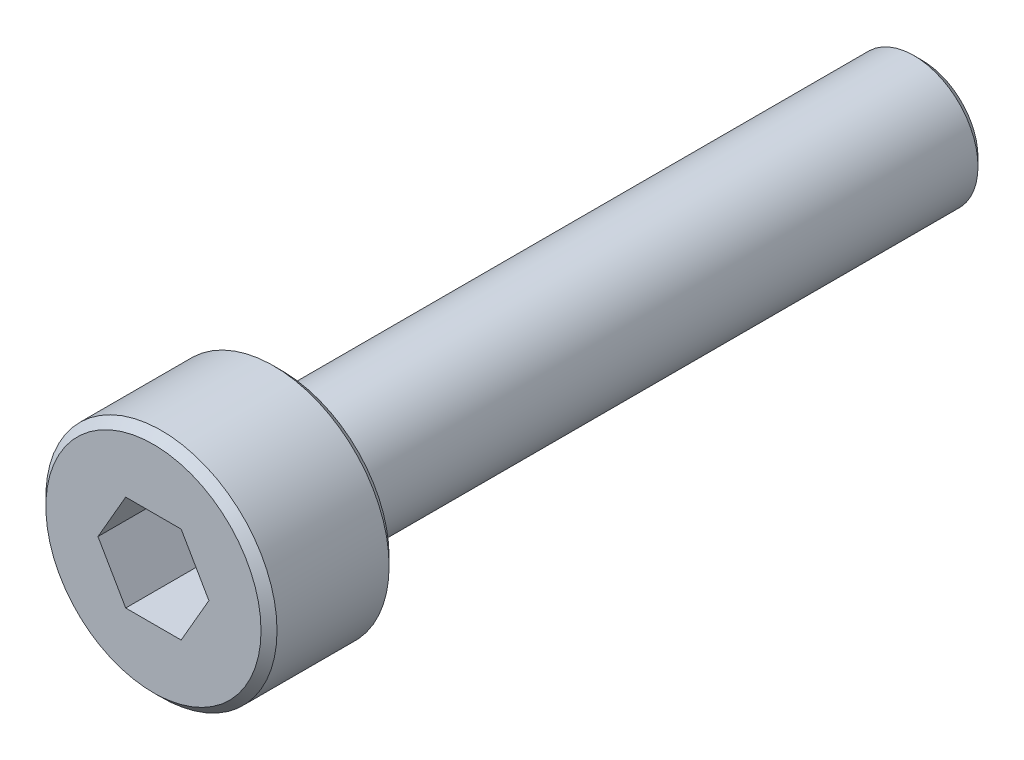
ISO-10303-21;
HEADER;
FILE_DESCRIPTION(('STEP AP214'),'2;1');
FILE_NAME('part.step','',(''),(''),'','','');
FILE_SCHEMA(('AUTOMOTIVE_DESIGN { 1 0 10303 214 1 1 1 1 }'));
ENDSEC;
DATA;
#1=APPLICATION_CONTEXT('core data for automotive mechanical design processes');
#2=APPLICATION_PROTOCOL_DEFINITION('international standard','automotive_design',2000,#1);
#3=PRODUCT_CONTEXT('',#1,'mechanical');
#4=PRODUCT('Part','Part','',(#3));
#5=PRODUCT_RELATED_PRODUCT_CATEGORY('part','',(#4));
#6=PRODUCT_DEFINITION_FORMATION('','',#4);
#7=PRODUCT_DEFINITION_CONTEXT('part definition',#1,'design');
#8=PRODUCT_DEFINITION('design','',#6,#7);
#9=PRODUCT_DEFINITION_SHAPE('','',#8);
#10=(LENGTH_UNIT() NAMED_UNIT(*) SI_UNIT(.MILLI.,.METRE.));
#11=(NAMED_UNIT(*) PLANE_ANGLE_UNIT() SI_UNIT($,.RADIAN.));
#12=(NAMED_UNIT(*) SI_UNIT($,.STERADIAN.) SOLID_ANGLE_UNIT());
#13=UNCERTAINTY_MEASURE_WITH_UNIT(LENGTH_MEASURE(1.E-05),#10,'distance_accuracy_value','');
#14=(GEOMETRIC_REPRESENTATION_CONTEXT(3) GLOBAL_UNCERTAINTY_ASSIGNED_CONTEXT((#13)) GLOBAL_UNIT_ASSIGNED_CONTEXT((#10,
#11,#12)) REPRESENTATION_CONTEXT('',''));
#15=CARTESIAN_POINT('',(0.,0.,0.));
#16=DIRECTION('',(0.,0.,1.));
#17=DIRECTION('',(1.,0.,0.));
#18=AXIS2_PLACEMENT_3D('',#15,#16,#17);
#19=CARTESIAN_POINT('',(0.,0.,20.));
#20=DIRECTION('',(0.,0.,-1.));
#21=DIRECTION('',(-1.,0.,0.));
#22=AXIS2_PLACEMENT_3D('',#19,#20,#21);
#23=CYLINDRICAL_SURFACE('',#22,2.);
#24=CARTESIAN_POINT('',(0.,0.,0.250000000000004));
#25=DIRECTION('',(0.,0.,1.));
#26=DIRECTION('',(1.,0.,0.));
#27=AXIS2_PLACEMENT_3D('',#24,#25,#26);
#28=CIRCLE('',#27,2.);
#29=CARTESIAN_POINT('',(2.,0.,0.250000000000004));
#30=VERTEX_POINT('',#29);
#31=EDGE_CURVE('E179',#30,#30,#28,.T.);
#32=ORIENTED_EDGE('',*,*,#31,.T.);
#33=EDGE_LOOP('',(#32));
#34=FACE_BOUND('',#33,.T.);
#35=CARTESIAN_POINT('',(0.,0.,20.));
#36=DIRECTION('',(0.,0.,1.));
#37=DIRECTION('',(1.,0.,0.));
#38=AXIS2_PLACEMENT_3D('',#35,#36,#37);
#39=CIRCLE('',#38,2.);
#40=CARTESIAN_POINT('',(2.,0.,20.));
#41=VERTEX_POINT('',#40);
#42=EDGE_CURVE('E162',#41,#41,#39,.T.);
#43=ORIENTED_EDGE('',*,*,#42,.F.);
#44=EDGE_LOOP('',(#43));
#45=FACE_BOUND('',#44,.T.);
#46=ADVANCED_FACE('F50',(#34,#45),#23,.T.);
#47=CARTESIAN_POINT('',(0.,0.,0.));
#48=DIRECTION('',(0.,0.,1.));
#49=DIRECTION('',(1.,0.,0.));
#50=AXIS2_PLACEMENT_3D('',#47,#48,#49);
#51=PLANE('',#50);
#52=CARTESIAN_POINT('',(0.,0.,0.));
#53=DIRECTION('',(0.,0.,1.));
#54=DIRECTION('',(1.,0.,0.));
#55=AXIS2_PLACEMENT_3D('',#52,#53,#54);
#56=CIRCLE('',#55,1.75);
#57=CARTESIAN_POINT('',(1.75,0.,0.));
#58=VERTEX_POINT('',#57);
#59=EDGE_CURVE('E177',#58,#58,#56,.F.);
#60=ORIENTED_EDGE('',*,*,#59,.T.);
#61=EDGE_LOOP('',(#60));
#62=FACE_BOUND('',#61,.T.);
#63=ADVANCED_FACE('F208',(#62),#51,.F.);
#64=CARTESIAN_POINT('',(0.,0.,24.));
#65=DIRECTION('',(0.,0.,-1.));
#66=DIRECTION('',(-1.,0.,0.));
#67=AXIS2_PLACEMENT_3D('',#64,#65,#66);
#68=CYLINDRICAL_SURFACE('',#67,3.61);
#69=CARTESIAN_POINT('',(0.,0.,20.25));
#70=DIRECTION('',(0.,0.,1.));
#71=DIRECTION('',(1.,0.,0.));
#72=AXIS2_PLACEMENT_3D('',#69,#70,#71);
#73=CIRCLE('',#72,3.61);
#74=CARTESIAN_POINT('',(3.61,0.,20.25));
#75=VERTEX_POINT('',#74);
#76=EDGE_CURVE('E186',#75,#75,#73,.T.);
#77=ORIENTED_EDGE('',*,*,#76,.T.);
#78=EDGE_LOOP('',(#77));
#79=FACE_BOUND('',#78,.T.);
#80=CARTESIAN_POINT('',(0.,0.,23.75));
#81=DIRECTION('',(0.,0.,1.));
#82=DIRECTION('',(1.,0.,0.));
#83=AXIS2_PLACEMENT_3D('',#80,#81,#82);
#84=CIRCLE('',#83,3.61);
#85=CARTESIAN_POINT('',(3.61,0.,23.75));
#86=VERTEX_POINT('',#85);
#87=EDGE_CURVE('E184',#86,#86,#84,.F.);
#88=ORIENTED_EDGE('',*,*,#87,.T.);
#89=EDGE_LOOP('',(#88));
#90=FACE_BOUND('',#89,.T.);
#91=ADVANCED_FACE('F204',(#79,#90),#68,.T.);
#92=CARTESIAN_POINT('',(0.,0.,24.));
#93=DIRECTION('',(0.,0.,1.));
#94=DIRECTION('',(1.,0.,0.));
#95=AXIS2_PLACEMENT_3D('',#92,#93,#94);
#96=PLANE('',#95);
#97=CARTESIAN_POINT('',(0.,0.,24.));
#98=DIRECTION('',(0.,0.,1.));
#99=DIRECTION('',(1.,0.,0.));
#100=AXIS2_PLACEMENT_3D('',#97,#98,#99);
#101=CIRCLE('',#100,3.35999999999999);
#102=CARTESIAN_POINT('',(3.35999999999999,0.,24.));
#103=VERTEX_POINT('',#102);
#104=EDGE_CURVE('E11',#103,#103,#101,.T.);
#105=ORIENTED_EDGE('',*,*,#104,.T.);
#106=EDGE_LOOP('',(#105));
#107=FACE_BOUND('',#106,.T.);
#108=DIRECTION('',(0.5,0.866025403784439,0.));
#109=VECTOR('',#108,1.);
#110=CARTESIAN_POINT('',(0.866025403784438,-1.5,24.));
#111=LINE('',#110,#109);
#112=CARTESIAN_POINT('',(0.866025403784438,-1.5,24.));
#113=VERTEX_POINT('',#112);
#114=CARTESIAN_POINT('',(1.73205080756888,0.,24.));
#115=VERTEX_POINT('',#114);
#116=EDGE_CURVE('E64',#113,#115,#111,.T.);
#117=ORIENTED_EDGE('',*,*,#116,.F.);
#118=DIRECTION('',(1.,0.,0.));
#119=VECTOR('',#118,1.);
#120=CARTESIAN_POINT('',(-0.866025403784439,-1.5,24.));
#121=LINE('',#120,#119);
#122=CARTESIAN_POINT('',(-0.866025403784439,-1.5,24.));
#123=VERTEX_POINT('',#122);
#124=EDGE_CURVE('E160',#123,#113,#121,.T.);
#125=ORIENTED_EDGE('',*,*,#124,.F.);
#126=DIRECTION('',(0.5,-0.866025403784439,0.));
#127=VECTOR('',#126,1.);
#128=CARTESIAN_POINT('',(-1.73205080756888,0.,24.));
#129=LINE('',#128,#127);
#130=CARTESIAN_POINT('',(-1.73205080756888,0.,24.));
#131=VERTEX_POINT('',#130);
#132=EDGE_CURVE('E152',#131,#123,#129,.T.);
#133=ORIENTED_EDGE('',*,*,#132,.F.);
#134=DIRECTION('',(-0.5,-0.866025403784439,0.));
#135=VECTOR('',#134,1.);
#136=CARTESIAN_POINT('',(-0.866025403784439,1.5,24.));
#137=LINE('',#136,#135);
#138=CARTESIAN_POINT('',(-0.866025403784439,1.5,24.));
#139=VERTEX_POINT('',#138);
#140=EDGE_CURVE('E115',#139,#131,#137,.T.);
#141=ORIENTED_EDGE('',*,*,#140,.F.);
#142=DIRECTION('',(-1.,0.,0.));
#143=VECTOR('',#142,1.);
#144=CARTESIAN_POINT('',(0.866025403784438,1.5,24.));
#145=LINE('',#144,#143);
#146=CARTESIAN_POINT('',(0.866025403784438,1.5,24.));
#147=VERTEX_POINT('',#146);
#148=EDGE_CURVE('E146',#147,#139,#145,.T.);
#149=ORIENTED_EDGE('',*,*,#148,.F.);
#150=DIRECTION('',(-0.5,0.866025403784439,0.));
#151=VECTOR('',#150,1.);
#152=CARTESIAN_POINT('',(1.73205080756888,0.,24.));
#153=LINE('',#152,#151);
#154=EDGE_CURVE('E145',#115,#147,#153,.T.);
#155=ORIENTED_EDGE('',*,*,#154,.F.);
#156=EDGE_LOOP('',(#117,#125,#133,#141,#149,#155));
#157=FACE_BOUND('',#156,.T.);
#158=ADVANCED_FACE('F210',(#107,#157),#96,.T.);
#159=CARTESIAN_POINT('',(0.,0.,20.));
#160=DIRECTION('',(0.,0.,1.));
#161=DIRECTION('',(1.,0.,0.));
#162=AXIS2_PLACEMENT_3D('',#159,#160,#161);
#163=PLANE('',#162);
#164=CARTESIAN_POINT('',(0.,0.,20.));
#165=DIRECTION('',(0.,0.,1.));
#166=DIRECTION('',(1.,0.,0.));
#167=AXIS2_PLACEMENT_3D('',#164,#165,#166);
#168=CIRCLE('',#167,3.36);
#169=CARTESIAN_POINT('',(3.36,0.,20.));
#170=VERTEX_POINT('',#169);
#171=EDGE_CURVE('E60',#170,#170,#168,.F.);
#172=ORIENTED_EDGE('',*,*,#171,.T.);
#173=EDGE_LOOP('',(#172));
#174=FACE_BOUND('',#173,.T.);
#175=ORIENTED_EDGE('',*,*,#42,.T.);
#176=EDGE_LOOP('',(#175));
#177=FACE_BOUND('',#176,.T.);
#178=ADVANCED_FACE('F192',(#174,#177),#163,.F.);
#179=CARTESIAN_POINT('',(0.866025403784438,-1.5,21.5));
#180=DIRECTION('',(0.866025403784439,-0.5,0.));
#181=DIRECTION('',(0.5,0.866025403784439,0.));
#182=AXIS2_PLACEMENT_3D('',#179,#180,#181);
#183=PLANE('',#182);
#184=ORIENTED_EDGE('',*,*,#116,.T.);
#185=DIRECTION('',(0.,0.,1.));
#186=VECTOR('',#185,1.);
#187=CARTESIAN_POINT('',(1.73205080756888,0.,21.5));
#188=LINE('',#187,#186);
#189=CARTESIAN_POINT('',(1.73205080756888,0.,21.5));
#190=VERTEX_POINT('',#189);
#191=EDGE_CURVE('E94',#190,#115,#188,.T.);
#192=ORIENTED_EDGE('',*,*,#191,.F.);
#193=DIRECTION('',(0.5,0.866025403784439,0.));
#194=VECTOR('',#193,1.);
#195=CARTESIAN_POINT('',(0.866025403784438,-1.5,21.5));
#196=LINE('',#195,#194);
#197=CARTESIAN_POINT('',(0.866025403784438,-1.5,21.5));
#198=VERTEX_POINT('',#197);
#199=EDGE_CURVE('E159',#198,#190,#196,.T.);
#200=ORIENTED_EDGE('',*,*,#199,.F.);
#201=DIRECTION('',(0.,0.,1.));
#202=VECTOR('',#201,1.);
#203=CARTESIAN_POINT('',(0.866025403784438,-1.5,21.5));
#204=LINE('',#203,#202);
#205=EDGE_CURVE('E75',#198,#113,#204,.T.);
#206=ORIENTED_EDGE('',*,*,#205,.T.);
#207=EDGE_LOOP('',(#184,#192,#200,#206));
#208=FACE_BOUND('',#207,.T.);
#209=ADVANCED_FACE('F230',(#208),#183,.F.);
#210=CARTESIAN_POINT('',(-0.866025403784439,-1.5,21.5));
#211=DIRECTION('',(0.,-1.,0.));
#212=DIRECTION('',(1.,0.,0.));
#213=AXIS2_PLACEMENT_3D('',#210,#211,#212);
#214=PLANE('',#213);
#215=ORIENTED_EDGE('',*,*,#124,.T.);
#216=ORIENTED_EDGE('',*,*,#205,.F.);
#217=DIRECTION('',(1.,0.,0.));
#218=VECTOR('',#217,1.);
#219=CARTESIAN_POINT('',(-0.866025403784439,-1.5,21.5));
#220=LINE('',#219,#218);
#221=CARTESIAN_POINT('',(-0.866025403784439,-1.5,21.5));
#222=VERTEX_POINT('',#221);
#223=EDGE_CURVE('E127',#222,#198,#220,.T.);
#224=ORIENTED_EDGE('',*,*,#223,.F.);
#225=DIRECTION('',(0.,0.,1.));
#226=VECTOR('',#225,1.);
#227=CARTESIAN_POINT('',(-0.866025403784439,-1.5,21.5));
#228=LINE('',#227,#226);
#229=EDGE_CURVE('E120',#222,#123,#228,.T.);
#230=ORIENTED_EDGE('',*,*,#229,.T.);
#231=EDGE_LOOP('',(#215,#216,#224,#230));
#232=FACE_BOUND('',#231,.T.);
#233=ADVANCED_FACE('F229',(#232),#214,.F.);
#234=CARTESIAN_POINT('',(-1.73205080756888,0.,21.5));
#235=DIRECTION('',(-0.866025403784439,-0.5,0.));
#236=DIRECTION('',(0.5,-0.866025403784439,0.));
#237=AXIS2_PLACEMENT_3D('',#234,#235,#236);
#238=PLANE('',#237);
#239=ORIENTED_EDGE('',*,*,#132,.T.);
#240=ORIENTED_EDGE('',*,*,#229,.F.);
#241=DIRECTION('',(0.5,-0.866025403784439,0.));
#242=VECTOR('',#241,1.);
#243=CARTESIAN_POINT('',(-1.73205080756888,0.,21.5));
#244=LINE('',#243,#242);
#245=CARTESIAN_POINT('',(-1.73205080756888,0.,21.5));
#246=VERTEX_POINT('',#245);
#247=EDGE_CURVE('E124',#246,#222,#244,.T.);
#248=ORIENTED_EDGE('',*,*,#247,.F.);
#249=DIRECTION('',(0.,0.,1.));
#250=VECTOR('',#249,1.);
#251=CARTESIAN_POINT('',(-1.73205080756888,0.,21.5));
#252=LINE('',#251,#250);
#253=EDGE_CURVE('E104',#246,#131,#252,.T.);
#254=ORIENTED_EDGE('',*,*,#253,.T.);
#255=EDGE_LOOP('',(#239,#240,#248,#254));
#256=FACE_BOUND('',#255,.T.);
#257=ADVANCED_FACE('F121',(#256),#238,.F.);
#258=CARTESIAN_POINT('',(-0.866025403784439,1.5,21.5));
#259=DIRECTION('',(-0.866025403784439,0.5,0.));
#260=DIRECTION('',(-0.5,-0.866025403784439,0.));
#261=AXIS2_PLACEMENT_3D('',#258,#259,#260);
#262=PLANE('',#261);
#263=ORIENTED_EDGE('',*,*,#140,.T.);
#264=ORIENTED_EDGE('',*,*,#253,.F.);
#265=DIRECTION('',(-0.5,-0.866025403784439,0.));
#266=VECTOR('',#265,1.);
#267=CARTESIAN_POINT('',(-0.866025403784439,1.5,21.5));
#268=LINE('',#267,#266);
#269=CARTESIAN_POINT('',(-0.866025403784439,1.5,21.5));
#270=VERTEX_POINT('',#269);
#271=EDGE_CURVE('E108',#270,#246,#268,.T.);
#272=ORIENTED_EDGE('',*,*,#271,.F.);
#273=DIRECTION('',(0.,0.,1.));
#274=VECTOR('',#273,1.);
#275=CARTESIAN_POINT('',(-0.866025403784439,1.5,21.5));
#276=LINE('',#275,#274);
#277=EDGE_CURVE('E116',#270,#139,#276,.T.);
#278=ORIENTED_EDGE('',*,*,#277,.T.);
#279=EDGE_LOOP('',(#263,#264,#272,#278));
#280=FACE_BOUND('',#279,.T.);
#281=ADVANCED_FACE('F110',(#280),#262,.F.);
#282=CARTESIAN_POINT('',(0.866025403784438,1.5,21.5));
#283=DIRECTION('',(0.,1.,0.));
#284=DIRECTION('',(-1.,0.,0.));
#285=AXIS2_PLACEMENT_3D('',#282,#283,#284);
#286=PLANE('',#285);
#287=ORIENTED_EDGE('',*,*,#148,.T.);
#288=ORIENTED_EDGE('',*,*,#277,.F.);
#289=DIRECTION('',(-1.,0.,0.));
#290=VECTOR('',#289,1.);
#291=CARTESIAN_POINT('',(0.866025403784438,1.5,21.5));
#292=LINE('',#291,#290);
#293=CARTESIAN_POINT('',(0.866025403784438,1.5,21.5));
#294=VERTEX_POINT('',#293);
#295=EDGE_CURVE('E135',#294,#270,#292,.T.);
#296=ORIENTED_EDGE('',*,*,#295,.F.);
#297=DIRECTION('',(0.,0.,1.));
#298=VECTOR('',#297,1.);
#299=CARTESIAN_POINT('',(0.866025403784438,1.5,21.5));
#300=LINE('',#299,#298);
#301=EDGE_CURVE('E169',#294,#147,#300,.T.);
#302=ORIENTED_EDGE('',*,*,#301,.T.);
#303=EDGE_LOOP('',(#287,#288,#296,#302));
#304=FACE_BOUND('',#303,.T.);
#305=ADVANCED_FACE('F268',(#304),#286,.F.);
#306=CARTESIAN_POINT('',(1.73205080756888,0.,21.5));
#307=DIRECTION('',(0.866025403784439,0.5,0.));
#308=DIRECTION('',(-0.5,0.866025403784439,0.));
#309=AXIS2_PLACEMENT_3D('',#306,#307,#308);
#310=PLANE('',#309);
#311=ORIENTED_EDGE('',*,*,#154,.T.);
#312=ORIENTED_EDGE('',*,*,#301,.F.);
#313=DIRECTION('',(-0.5,0.866025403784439,0.));
#314=VECTOR('',#313,1.);
#315=CARTESIAN_POINT('',(1.73205080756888,0.,21.5));
#316=LINE('',#315,#314);
#317=EDGE_CURVE('E139',#190,#294,#316,.T.);
#318=ORIENTED_EDGE('',*,*,#317,.F.);
#319=ORIENTED_EDGE('',*,*,#191,.T.);
#320=EDGE_LOOP('',(#311,#312,#318,#319));
#321=FACE_BOUND('',#320,.T.);
#322=ADVANCED_FACE('F224',(#321),#310,.F.);
#323=CARTESIAN_POINT('',(0.,0.,21.5));
#324=DIRECTION('',(0.,0.,1.));
#325=DIRECTION('',(1.,0.,0.));
#326=AXIS2_PLACEMENT_3D('',#323,#324,#325);
#327=PLANE('',#326);
#328=ORIENTED_EDGE('',*,*,#199,.T.);
#329=ORIENTED_EDGE('',*,*,#317,.T.);
#330=ORIENTED_EDGE('',*,*,#295,.T.);
#331=ORIENTED_EDGE('',*,*,#271,.T.);
#332=ORIENTED_EDGE('',*,*,#247,.T.);
#333=ORIENTED_EDGE('',*,*,#223,.T.);
#334=EDGE_LOOP('',(#328,#329,#330,#331,#332,#333));
#335=FACE_BOUND('',#334,.T.);
#336=ADVANCED_FACE('F129',(#335),#327,.T.);
#337=CARTESIAN_POINT('',(0.,0.,0.250000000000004));
#338=DIRECTION('',(0.,0.,1.));
#339=DIRECTION('',(1.,0.,0.));
#340=AXIS2_PLACEMENT_3D('',#337,#338,#339);
#341=CONICAL_SURFACE('',#340,2.,0.785398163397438);
#342=ORIENTED_EDGE('',*,*,#59,.F.);
#343=EDGE_LOOP('',(#342));
#344=FACE_BOUND('',#343,.T.);
#345=ORIENTED_EDGE('',*,*,#31,.F.);
#346=EDGE_LOOP('',(#345));
#347=FACE_BOUND('',#346,.T.);
#348=ADVANCED_FACE('F203',(#344,#347),#341,.T.);
#349=CARTESIAN_POINT('',(0.,0.,20.25));
#350=DIRECTION('',(0.,0.,1.));
#351=DIRECTION('',(1.,0.,0.));
#352=AXIS2_PLACEMENT_3D('',#349,#350,#351);
#353=CONICAL_SURFACE('',#352,3.61,0.785398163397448);
#354=ORIENTED_EDGE('',*,*,#171,.F.);
#355=EDGE_LOOP('',(#354));
#356=FACE_BOUND('',#355,.T.);
#357=ORIENTED_EDGE('',*,*,#76,.F.);
#358=EDGE_LOOP('',(#357));
#359=FACE_BOUND('',#358,.T.);
#360=ADVANCED_FACE('F196',(#356,#359),#353,.T.);
#361=CARTESIAN_POINT('',(0.,0.,24.));
#362=DIRECTION('',(0.,0.,-1.));
#363=DIRECTION('',(-1.,0.,0.));
#364=AXIS2_PLACEMENT_3D('',#361,#362,#363);
#365=CONICAL_SURFACE('',#364,3.35999999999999,0.785398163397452);
#366=ORIENTED_EDGE('',*,*,#87,.F.);
#367=EDGE_LOOP('',(#366));
#368=FACE_BOUND('',#367,.T.);
#369=ORIENTED_EDGE('',*,*,#104,.F.);
#370=EDGE_LOOP('',(#369));
#371=FACE_BOUND('',#370,.T.);
#372=ADVANCED_FACE('F49',(#368,#371),#365,.T.);
#373=CLOSED_SHELL('',(#46,#63,#91,#158,#178,#209,#233,#257,#281,#305,#322,#336,#348,#360,#372));
#374=MANIFOLD_SOLID_BREP('B2',#373);
#375=ADVANCED_BREP_SHAPE_REPRESENTATION('',(#18,#374),#14);
#376=SHAPE_DEFINITION_REPRESENTATION(#9,#375);
ENDSEC;
END-ISO-10303-21;
